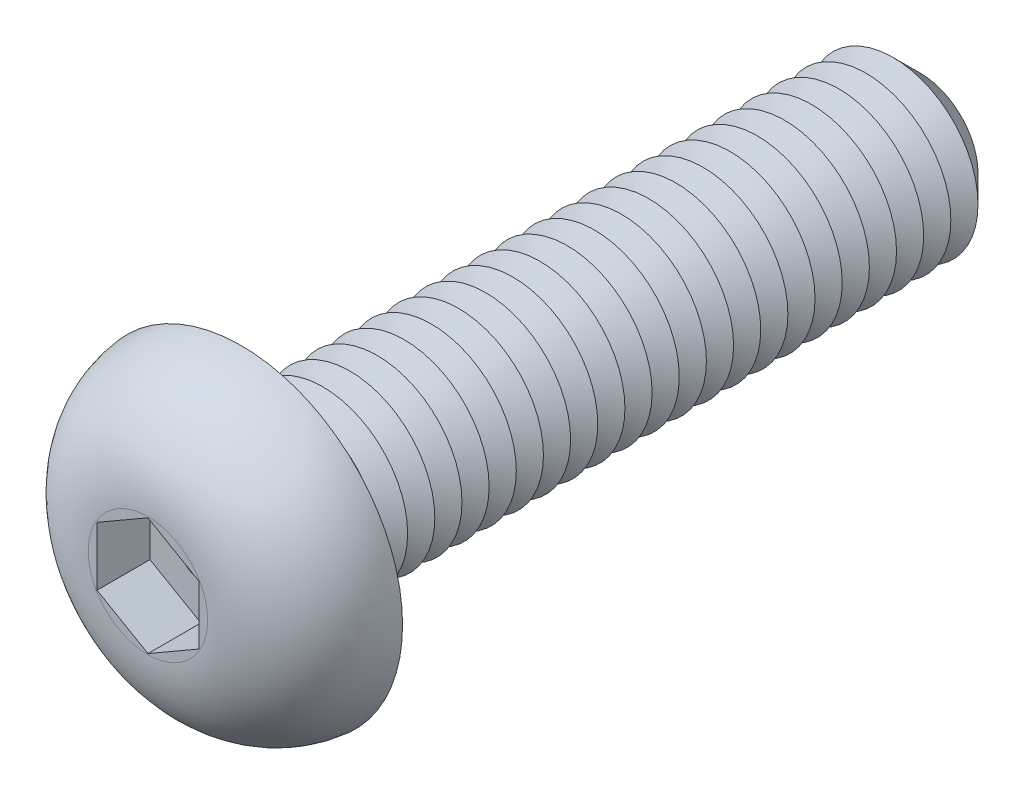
from build123d import *

# Parameters (mm, degrees)
CUT_EXTRUDE1_DEPTH  = 1.56
SKETCH4_R           = 2.5
BOSS_EXTRUDE1_DEPTH = 20
CHAMFER1_SIZE       = 0.8
LPATTERN1_COUNT     = 23
LPATTERN1_PITCH     = 0.8
FILLET2_R           = 0.4
SKETCH6_R           = 0.65
CUT_EXTRUDE2_DEPTH  = 21.19


with BuildPart() as part:
    # Sketch2 → Revolve1 (revolve)
    with BuildSketch(Plane(origin=(0, 0, 0), x_dir=(0, 0, -1), z_dir=(1, 0, 0)), mode=Mode.PRIVATE) as revolve1_sk:
        with BuildLine():
            Line((0, 0), (-2.75, 0))
            Line((-2.75, 0), (-2.75, 1.760434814))
            ThreePointArc((-2.75, 1.760434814), (-1.957940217, 3.791444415), (0, 4.75))
            Line((0, 4.75), (0, 0))
        make_face()
    revolve(revolve1_sk.sketch.rotate(Axis((0, 0, 47.934239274), (0, 0, -1)), 90), axis=Axis((0, 0, 47.934239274), (0, 0, -1)))

    # Sketch3 → Cut-Extrude1 (cut)
    with BuildSketch(Plane.XY.offset(2.75)):
        Polygon((0, 1.732050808), (-1.5, 0.866025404), (-1.5, -0.866025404), (0, -1.732050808), (1.5, -0.866025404), (1.5, 0.866025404), align=None)
    extrude(amount=-CUT_EXTRUDE1_DEPTH, mode=Mode.SUBTRACT)

    # Sketch4 → Boss-Extrude1 (add)
    with BuildSketch(Plane(origin=(0, 0, 0), x_dir=(-1, 0, 0), z_dir=(0, 0, -1))):
        with Locations(Location((0, 0, 0), (0, 0, 180))):
            Circle(SKETCH4_R)
    extrude(amount=BOSS_EXTRUDE1_DEPTH)

    # Chamfer1
    chamfer1_edges = [part.edges().sort_by_distance(p)[0] for p in [
        (-2.5, 0, -20),
    ]]
    chamfer(chamfer1_edges, length=CHAMFER1_SIZE)

    # Sketch5 → Cut-Revolve1 (revolve, cut)
    with BuildSketch(Plane(origin=(0, 0, 0), x_dir=(0, 0, -1), z_dir=(1, 0, 0)), mode=Mode.PRIVATE) as cut_revolve1_sk:
        Polygon((0.8, 2.5), (1.6, 2.5), (1.2, 1.807179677), align=None)
    cut_revolve1 = revolve(cut_revolve1_sk.sketch.rotate(Axis((0, 0, 47.934239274), (0, 0, -1)), 90), axis=Axis((0, 0, 47.934239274), (0, 0, -1)), mode=Mode.SUBTRACT)

    # LPattern1: Cut-Revolve1 ×23
    with Locations(*[(0, 0, -i * LPATTERN1_PITCH) for i in range(1, LPATTERN1_COUNT)]):
        add(cut_revolve1, mode=Mode.SUBTRACT)

    # Fillet2
    fillet2_edges = [part.edges().sort_by_distance(p)[0] for p in [
        (-2.5, 0, 0),
    ]]
    fillet(fillet2_edges, radius=FILLET2_R)

    # Sketch6 → Cut-Extrude2 (cut)
    with BuildSketch(Plane.XY.offset(1.19)):
        Circle(SKETCH6_R)
    extrude(amount=-CUT_EXTRUDE2_DEPTH, mode=Mode.SUBTRACT)


solid = part.part
